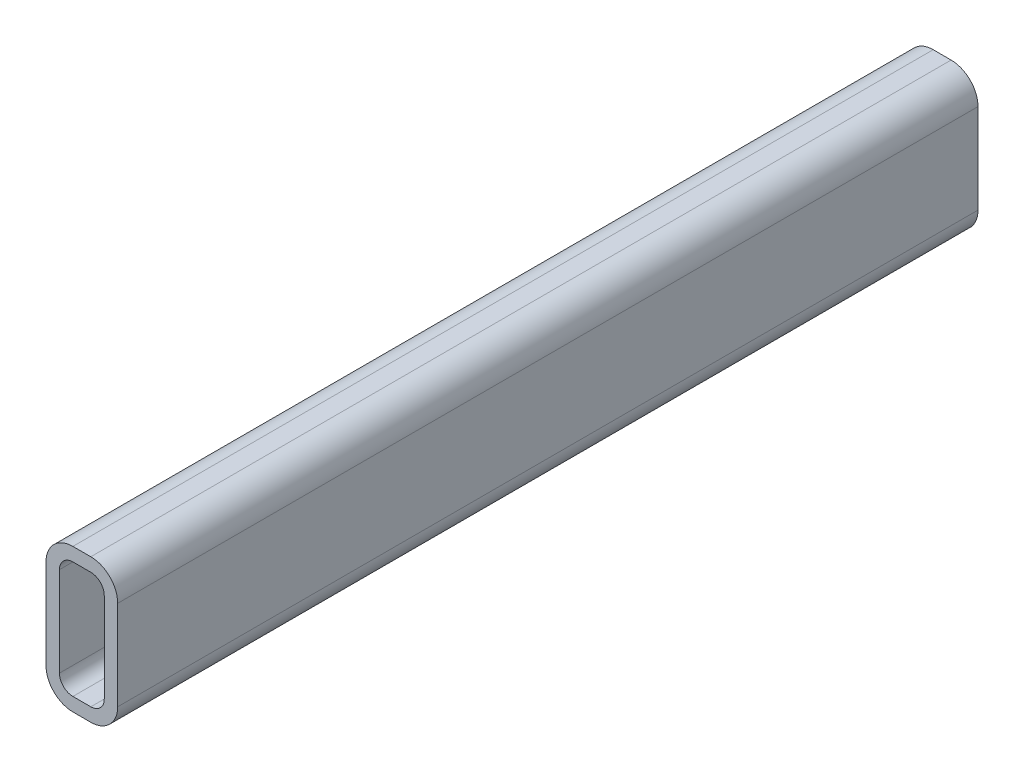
ISO-10303-21;
HEADER;
FILE_DESCRIPTION(('STEP AP214'),'2;1');
FILE_NAME('part.step','',(''),(''),'','','');
FILE_SCHEMA(('AUTOMOTIVE_DESIGN { 1 0 10303 214 1 1 1 1 }'));
ENDSEC;
DATA;
#1=APPLICATION_CONTEXT('core data for automotive mechanical design processes');
#2=APPLICATION_PROTOCOL_DEFINITION('international standard','automotive_design',2000,#1);
#3=PRODUCT_CONTEXT('',#1,'mechanical');
#4=PRODUCT('Part','Part','',(#3));
#5=PRODUCT_RELATED_PRODUCT_CATEGORY('part','',(#4));
#6=PRODUCT_DEFINITION_FORMATION('','',#4);
#7=PRODUCT_DEFINITION_CONTEXT('part definition',#1,'design');
#8=PRODUCT_DEFINITION('design','',#6,#7);
#9=PRODUCT_DEFINITION_SHAPE('','',#8);
#10=(LENGTH_UNIT() NAMED_UNIT(*) SI_UNIT(.MILLI.,.METRE.));
#11=(NAMED_UNIT(*) PLANE_ANGLE_UNIT() SI_UNIT($,.RADIAN.));
#12=(NAMED_UNIT(*) SI_UNIT($,.STERADIAN.) SOLID_ANGLE_UNIT());
#13=UNCERTAINTY_MEASURE_WITH_UNIT(LENGTH_MEASURE(1.E-05),#10,'distance_accuracy_value','');
#14=(GEOMETRIC_REPRESENTATION_CONTEXT(3) GLOBAL_UNCERTAINTY_ASSIGNED_CONTEXT((#13)) GLOBAL_UNIT_ASSIGNED_CONTEXT((#10,
#11,#12)) REPRESENTATION_CONTEXT('',''));
#15=CARTESIAN_POINT('',(0.,0.,0.));
#16=DIRECTION('',(0.,0.,1.));
#17=DIRECTION('',(1.,0.,0.));
#18=AXIS2_PLACEMENT_3D('',#15,#16,#17);
#19=CARTESIAN_POINT('',(9.525,41.275,304.8));
#20=DIRECTION('',(0.,0.,1.));
#21=DIRECTION('',(1.,0.,0.));
#22=AXIS2_PLACEMENT_3D('',#19,#20,#21);
#23=PLANE('',#22);
#24=CARTESIAN_POINT('',(9.525,41.275,304.8));
#25=DIRECTION('',(0.,0.,1.));
#26=DIRECTION('',(1.,0.,0.));
#27=AXIS2_PLACEMENT_3D('',#24,#25,#26);
#28=CIRCLE('',#27,9.525);
#29=CARTESIAN_POINT('',(9.525,50.8,304.8));
#30=VERTEX_POINT('',#29);
#31=CARTESIAN_POINT('',(0.,41.275,304.8));
#32=VERTEX_POINT('',#31);
#33=EDGE_CURVE('E211',#30,#32,#28,.T.);
#34=ORIENTED_EDGE('',*,*,#33,.T.);
#35=DIRECTION('',(0.,-1.,0.));
#36=VECTOR('',#35,1.);
#37=CARTESIAN_POINT('',(0.,9.525,304.8));
#38=LINE('',#37,#36);
#39=CARTESIAN_POINT('',(0.,9.525,304.8));
#40=VERTEX_POINT('',#39);
#41=EDGE_CURVE('E214',#32,#40,#38,.T.);
#42=ORIENTED_EDGE('',*,*,#41,.T.);
#43=CARTESIAN_POINT('',(9.525,9.525,304.8));
#44=DIRECTION('',(0.,0.,1.));
#45=DIRECTION('',(1.,0.,0.));
#46=AXIS2_PLACEMENT_3D('',#43,#44,#45);
#47=CIRCLE('',#46,9.525);
#48=CARTESIAN_POINT('',(9.525,0.,304.8));
#49=VERTEX_POINT('',#48);
#50=EDGE_CURVE('E217',#40,#49,#47,.T.);
#51=ORIENTED_EDGE('',*,*,#50,.T.);
#52=DIRECTION('',(1.,0.,0.));
#53=VECTOR('',#52,1.);
#54=CARTESIAN_POINT('',(15.875,0.,304.8));
#55=LINE('',#54,#53);
#56=CARTESIAN_POINT('',(15.875,0.,304.8));
#57=VERTEX_POINT('',#56);
#58=EDGE_CURVE('E219',#49,#57,#55,.T.);
#59=ORIENTED_EDGE('',*,*,#58,.T.);
#60=CARTESIAN_POINT('',(15.875,9.525,304.8));
#61=DIRECTION('',(0.,0.,1.));
#62=DIRECTION('',(1.,0.,0.));
#63=AXIS2_PLACEMENT_3D('',#60,#61,#62);
#64=CIRCLE('',#63,9.525);
#65=CARTESIAN_POINT('',(25.4,9.525,304.8));
#66=VERTEX_POINT('',#65);
#67=EDGE_CURVE('E221',#57,#66,#64,.T.);
#68=ORIENTED_EDGE('',*,*,#67,.T.);
#69=DIRECTION('',(0.,1.,0.));
#70=VECTOR('',#69,1.);
#71=CARTESIAN_POINT('',(25.4,41.275,304.8));
#72=LINE('',#71,#70);
#73=CARTESIAN_POINT('',(25.4,41.275,304.8));
#74=VERTEX_POINT('',#73);
#75=EDGE_CURVE('E223',#66,#74,#72,.T.);
#76=ORIENTED_EDGE('',*,*,#75,.T.);
#77=CARTESIAN_POINT('',(15.875,41.275,304.8));
#78=DIRECTION('',(0.,0.,1.));
#79=DIRECTION('',(1.,0.,0.));
#80=AXIS2_PLACEMENT_3D('',#77,#78,#79);
#81=CIRCLE('',#80,9.525);
#82=CARTESIAN_POINT('',(15.875,50.8,304.8));
#83=VERTEX_POINT('',#82);
#84=EDGE_CURVE('E225',#74,#83,#81,.T.);
#85=ORIENTED_EDGE('',*,*,#84,.T.);
#86=DIRECTION('',(-1.,0.,0.));
#87=VECTOR('',#86,1.);
#88=CARTESIAN_POINT('',(9.525,50.8,304.8));
#89=LINE('',#88,#87);
#90=EDGE_CURVE('E227',#83,#30,#89,.T.);
#91=ORIENTED_EDGE('',*,*,#90,.T.);
#92=EDGE_LOOP('',(#34,#42,#51,#59,#68,#76,#85,#91));
#93=FACE_BOUND('',#92,.T.);
#94=DIRECTION('',(0.,-1.,0.));
#95=VECTOR('',#94,1.);
#96=CARTESIAN_POINT('',(4.7625,9.525,304.8));
#97=LINE('',#96,#95);
#98=CARTESIAN_POINT('',(4.7625,41.275,304.8));
#99=VERTEX_POINT('',#98);
#100=CARTESIAN_POINT('',(4.7625,9.525,304.8));
#101=VERTEX_POINT('',#100);
#102=EDGE_CURVE('E154',#99,#101,#97,.T.);
#103=ORIENTED_EDGE('',*,*,#102,.F.);
#104=CARTESIAN_POINT('',(9.525,41.275,304.8));
#105=DIRECTION('',(0.,0.,1.));
#106=DIRECTION('',(1.,0.,0.));
#107=AXIS2_PLACEMENT_3D('',#104,#105,#106);
#108=CIRCLE('',#107,4.7625);
#109=CARTESIAN_POINT('',(9.525,46.0375,304.8));
#110=VERTEX_POINT('',#109);
#111=EDGE_CURVE('E146',#110,#99,#108,.T.);
#112=ORIENTED_EDGE('',*,*,#111,.F.);
#113=DIRECTION('',(-1.,0.,0.));
#114=VECTOR('',#113,1.);
#115=CARTESIAN_POINT('',(9.525,46.0375,304.8));
#116=LINE('',#115,#114);
#117=CARTESIAN_POINT('',(15.875,46.0375,304.8));
#118=VERTEX_POINT('',#117);
#119=EDGE_CURVE('E179',#118,#110,#116,.T.);
#120=ORIENTED_EDGE('',*,*,#119,.F.);
#121=CARTESIAN_POINT('',(15.875,41.275,304.8));
#122=DIRECTION('',(0.,0.,1.));
#123=DIRECTION('',(1.,0.,0.));
#124=AXIS2_PLACEMENT_3D('',#121,#122,#123);
#125=CIRCLE('',#124,4.7625);
#126=CARTESIAN_POINT('',(20.6375,41.275,304.8));
#127=VERTEX_POINT('',#126);
#128=EDGE_CURVE('E177',#127,#118,#125,.T.);
#129=ORIENTED_EDGE('',*,*,#128,.F.);
#130=DIRECTION('',(0.,1.,0.));
#131=VECTOR('',#130,1.);
#132=CARTESIAN_POINT('',(20.6375,41.275,304.8));
#133=LINE('',#132,#131);
#134=CARTESIAN_POINT('',(20.6375,9.525,304.8));
#135=VERTEX_POINT('',#134);
#136=EDGE_CURVE('E175',#135,#127,#133,.T.);
#137=ORIENTED_EDGE('',*,*,#136,.F.);
#138=CARTESIAN_POINT('',(15.875,9.525,304.8));
#139=DIRECTION('',(0.,0.,1.));
#140=DIRECTION('',(1.,0.,0.));
#141=AXIS2_PLACEMENT_3D('',#138,#139,#140);
#142=CIRCLE('',#141,4.7625);
#143=CARTESIAN_POINT('',(15.875,4.7625,304.8));
#144=VERTEX_POINT('',#143);
#145=EDGE_CURVE('E173',#144,#135,#142,.T.);
#146=ORIENTED_EDGE('',*,*,#145,.F.);
#147=DIRECTION('',(1.,0.,0.));
#148=VECTOR('',#147,1.);
#149=CARTESIAN_POINT('',(15.875,4.7625,304.8));
#150=LINE('',#149,#148);
#151=CARTESIAN_POINT('',(9.525,4.7625,304.8));
#152=VERTEX_POINT('',#151);
#153=EDGE_CURVE('E169',#152,#144,#150,.T.);
#154=ORIENTED_EDGE('',*,*,#153,.F.);
#155=CARTESIAN_POINT('',(9.525,9.525,304.8));
#156=DIRECTION('',(0.,0.,1.));
#157=DIRECTION('',(1.,0.,0.));
#158=AXIS2_PLACEMENT_3D('',#155,#156,#157);
#159=CIRCLE('',#158,4.7625);
#160=EDGE_CURVE('E167',#101,#152,#159,.T.);
#161=ORIENTED_EDGE('',*,*,#160,.F.);
#162=EDGE_LOOP('',(#103,#112,#120,#129,#137,#146,#154,#161));
#163=FACE_BOUND('',#162,.T.);
#164=ADVANCED_FACE('F33',(#93,#163),#23,.T.);
#165=CARTESIAN_POINT('',(9.525,41.275,0.));
#166=DIRECTION('',(0.,0.,1.));
#167=DIRECTION('',(1.,0.,0.));
#168=AXIS2_PLACEMENT_3D('',#165,#166,#167);
#169=PLANE('',#168);
#170=CARTESIAN_POINT('',(9.525,41.275,0.));
#171=DIRECTION('',(0.,0.,1.));
#172=DIRECTION('',(1.,0.,0.));
#173=AXIS2_PLACEMENT_3D('',#170,#171,#172);
#174=CIRCLE('',#173,9.525);
#175=CARTESIAN_POINT('',(9.525,50.8,0.));
#176=VERTEX_POINT('',#175);
#177=CARTESIAN_POINT('',(0.,41.275,0.));
#178=VERTEX_POINT('',#177);
#179=EDGE_CURVE('E162',#176,#178,#174,.T.);
#180=ORIENTED_EDGE('',*,*,#179,.F.);
#181=DIRECTION('',(-1.,0.,0.));
#182=VECTOR('',#181,1.);
#183=CARTESIAN_POINT('',(9.525,50.8,0.));
#184=LINE('',#183,#182);
#185=CARTESIAN_POINT('',(15.875,50.8,0.));
#186=VERTEX_POINT('',#185);
#187=EDGE_CURVE('E215',#186,#176,#184,.T.);
#188=ORIENTED_EDGE('',*,*,#187,.F.);
#189=CARTESIAN_POINT('',(15.875,41.275,0.));
#190=DIRECTION('',(0.,0.,1.));
#191=DIRECTION('',(1.,0.,0.));
#192=AXIS2_PLACEMENT_3D('',#189,#190,#191);
#193=CIRCLE('',#192,9.525);
#194=CARTESIAN_POINT('',(25.4,41.275,0.));
#195=VERTEX_POINT('',#194);
#196=EDGE_CURVE('E242',#195,#186,#193,.T.);
#197=ORIENTED_EDGE('',*,*,#196,.F.);
#198=DIRECTION('',(0.,1.,0.));
#199=VECTOR('',#198,1.);
#200=CARTESIAN_POINT('',(25.4,41.275,0.));
#201=LINE('',#200,#199);
#202=CARTESIAN_POINT('',(25.4,9.525,0.));
#203=VERTEX_POINT('',#202);
#204=EDGE_CURVE('E240',#203,#195,#201,.T.);
#205=ORIENTED_EDGE('',*,*,#204,.F.);
#206=CARTESIAN_POINT('',(15.875,9.525,0.));
#207=DIRECTION('',(0.,0.,1.));
#208=DIRECTION('',(1.,0.,0.));
#209=AXIS2_PLACEMENT_3D('',#206,#207,#208);
#210=CIRCLE('',#209,9.525);
#211=CARTESIAN_POINT('',(15.875,0.,0.));
#212=VERTEX_POINT('',#211);
#213=EDGE_CURVE('E238',#212,#203,#210,.T.);
#214=ORIENTED_EDGE('',*,*,#213,.F.);
#215=DIRECTION('',(1.,0.,0.));
#216=VECTOR('',#215,1.);
#217=CARTESIAN_POINT('',(15.875,0.,0.));
#218=LINE('',#217,#216);
#219=CARTESIAN_POINT('',(9.525,0.,0.));
#220=VERTEX_POINT('',#219);
#221=EDGE_CURVE('E236',#220,#212,#218,.T.);
#222=ORIENTED_EDGE('',*,*,#221,.F.);
#223=CARTESIAN_POINT('',(9.525,9.525,0.));
#224=DIRECTION('',(0.,0.,1.));
#225=DIRECTION('',(1.,0.,0.));
#226=AXIS2_PLACEMENT_3D('',#223,#224,#225);
#227=CIRCLE('',#226,9.525);
#228=CARTESIAN_POINT('',(0.,9.525,0.));
#229=VERTEX_POINT('',#228);
#230=EDGE_CURVE('E234',#229,#220,#227,.T.);
#231=ORIENTED_EDGE('',*,*,#230,.F.);
#232=DIRECTION('',(0.,-1.,0.));
#233=VECTOR('',#232,1.);
#234=CARTESIAN_POINT('',(0.,9.525,0.));
#235=LINE('',#234,#233);
#236=EDGE_CURVE('E232',#178,#229,#235,.T.);
#237=ORIENTED_EDGE('',*,*,#236,.F.);
#238=EDGE_LOOP('',(#180,#188,#197,#205,#214,#222,#231,#237));
#239=FACE_BOUND('',#238,.T.);
#240=CARTESIAN_POINT('',(9.525,41.275,0.));
#241=DIRECTION('',(0.,0.,1.));
#242=DIRECTION('',(1.,0.,0.));
#243=AXIS2_PLACEMENT_3D('',#240,#241,#242);
#244=CIRCLE('',#243,4.7625);
#245=CARTESIAN_POINT('',(9.525,46.0375,0.));
#246=VERTEX_POINT('',#245);
#247=CARTESIAN_POINT('',(4.7625,41.275,0.));
#248=VERTEX_POINT('',#247);
#249=EDGE_CURVE('E56',#246,#248,#244,.T.);
#250=ORIENTED_EDGE('',*,*,#249,.T.);
#251=DIRECTION('',(0.,-1.,0.));
#252=VECTOR('',#251,1.);
#253=CARTESIAN_POINT('',(4.7625,9.525,0.));
#254=LINE('',#253,#252);
#255=CARTESIAN_POINT('',(4.7625,9.525,0.));
#256=VERTEX_POINT('',#255);
#257=EDGE_CURVE('E161',#248,#256,#254,.T.);
#258=ORIENTED_EDGE('',*,*,#257,.T.);
#259=CARTESIAN_POINT('',(9.525,9.525,0.));
#260=DIRECTION('',(0.,0.,1.));
#261=DIRECTION('',(1.,0.,0.));
#262=AXIS2_PLACEMENT_3D('',#259,#260,#261);
#263=CIRCLE('',#262,4.7625);
#264=CARTESIAN_POINT('',(9.525,4.7625,0.));
#265=VERTEX_POINT('',#264);
#266=EDGE_CURVE('E183',#256,#265,#263,.T.);
#267=ORIENTED_EDGE('',*,*,#266,.T.);
#268=DIRECTION('',(1.,0.,0.));
#269=VECTOR('',#268,1.);
#270=CARTESIAN_POINT('',(15.875,4.7625,0.));
#271=LINE('',#270,#269);
#272=CARTESIAN_POINT('',(15.875,4.7625,0.));
#273=VERTEX_POINT('',#272);
#274=EDGE_CURVE('E186',#265,#273,#271,.T.);
#275=ORIENTED_EDGE('',*,*,#274,.T.);
#276=CARTESIAN_POINT('',(15.875,9.525,0.));
#277=DIRECTION('',(0.,0.,1.));
#278=DIRECTION('',(1.,0.,0.));
#279=AXIS2_PLACEMENT_3D('',#276,#277,#278);
#280=CIRCLE('',#279,4.7625);
#281=CARTESIAN_POINT('',(20.6375,9.525,0.));
#282=VERTEX_POINT('',#281);
#283=EDGE_CURVE('E189',#273,#282,#280,.T.);
#284=ORIENTED_EDGE('',*,*,#283,.T.);
#285=DIRECTION('',(0.,1.,0.));
#286=VECTOR('',#285,1.);
#287=CARTESIAN_POINT('',(20.6375,41.275,0.));
#288=LINE('',#287,#286);
#289=CARTESIAN_POINT('',(20.6375,41.275,0.));
#290=VERTEX_POINT('',#289);
#291=EDGE_CURVE('E192',#282,#290,#288,.T.);
#292=ORIENTED_EDGE('',*,*,#291,.T.);
#293=CARTESIAN_POINT('',(15.875,41.275,0.));
#294=DIRECTION('',(0.,0.,1.));
#295=DIRECTION('',(1.,0.,0.));
#296=AXIS2_PLACEMENT_3D('',#293,#294,#295);
#297=CIRCLE('',#296,4.7625);
#298=CARTESIAN_POINT('',(15.875,46.0375,0.));
#299=VERTEX_POINT('',#298);
#300=EDGE_CURVE('E195',#290,#299,#297,.T.);
#301=ORIENTED_EDGE('',*,*,#300,.T.);
#302=DIRECTION('',(-1.,0.,0.));
#303=VECTOR('',#302,1.);
#304=CARTESIAN_POINT('',(9.525,46.0375,0.));
#305=LINE('',#304,#303);
#306=EDGE_CURVE('E155',#299,#246,#305,.T.);
#307=ORIENTED_EDGE('',*,*,#306,.T.);
#308=EDGE_LOOP('',(#250,#258,#267,#275,#284,#292,#301,#307));
#309=FACE_BOUND('',#308,.T.);
#310=ADVANCED_FACE('F272',(#239,#309),#169,.F.);
#311=CARTESIAN_POINT('',(9.525,41.275,304.8));
#312=DIRECTION('',(0.,0.,-1.));
#313=DIRECTION('',(-1.,0.,0.));
#314=AXIS2_PLACEMENT_3D('',#311,#312,#313);
#315=CYLINDRICAL_SURFACE('',#314,9.525);
#316=ORIENTED_EDGE('',*,*,#179,.T.);
#317=DIRECTION('',(0.,0.,-1.));
#318=VECTOR('',#317,1.);
#319=CARTESIAN_POINT('',(0.,41.275,304.8));
#320=LINE('',#319,#318);
#321=EDGE_CURVE('E11',#32,#178,#320,.T.);
#322=ORIENTED_EDGE('',*,*,#321,.F.);
#323=ORIENTED_EDGE('',*,*,#33,.F.);
#324=DIRECTION('',(0.,0.,-1.));
#325=VECTOR('',#324,1.);
#326=CARTESIAN_POINT('',(9.525,50.8,304.8));
#327=LINE('',#326,#325);
#328=EDGE_CURVE('E229',#30,#176,#327,.T.);
#329=ORIENTED_EDGE('',*,*,#328,.T.);
#330=EDGE_LOOP('',(#316,#322,#323,#329));
#331=FACE_BOUND('',#330,.T.);
#332=ADVANCED_FACE('F35',(#331),#315,.T.);
#333=CARTESIAN_POINT('',(0.,9.525,304.8));
#334=DIRECTION('',(1.,0.,0.));
#335=DIRECTION('',(0.,0.,-1.));
#336=AXIS2_PLACEMENT_3D('',#333,#334,#335);
#337=PLANE('',#336);
#338=ORIENTED_EDGE('',*,*,#236,.T.);
#339=DIRECTION('',(0.,0.,-1.));
#340=VECTOR('',#339,1.);
#341=CARTESIAN_POINT('',(0.,9.525,304.8));
#342=LINE('',#341,#340);
#343=EDGE_CURVE('E41',#40,#229,#342,.T.);
#344=ORIENTED_EDGE('',*,*,#343,.F.);
#345=ORIENTED_EDGE('',*,*,#41,.F.);
#346=ORIENTED_EDGE('',*,*,#321,.T.);
#347=EDGE_LOOP('',(#338,#344,#345,#346));
#348=FACE_BOUND('',#347,.T.);
#349=ADVANCED_FACE('F289',(#348),#337,.F.);
#350=CARTESIAN_POINT('',(9.525,9.525,304.8));
#351=DIRECTION('',(0.,0.,-1.));
#352=DIRECTION('',(-1.,0.,0.));
#353=AXIS2_PLACEMENT_3D('',#350,#351,#352);
#354=CYLINDRICAL_SURFACE('',#353,9.525);
#355=ORIENTED_EDGE('',*,*,#230,.T.);
#356=DIRECTION('',(0.,0.,-1.));
#357=VECTOR('',#356,1.);
#358=CARTESIAN_POINT('',(9.525,0.,304.8));
#359=LINE('',#358,#357);
#360=EDGE_CURVE('E259',#49,#220,#359,.T.);
#361=ORIENTED_EDGE('',*,*,#360,.F.);
#362=ORIENTED_EDGE('',*,*,#50,.F.);
#363=ORIENTED_EDGE('',*,*,#343,.T.);
#364=EDGE_LOOP('',(#355,#361,#362,#363));
#365=FACE_BOUND('',#364,.T.);
#366=ADVANCED_FACE('F266',(#365),#354,.T.);
#367=CARTESIAN_POINT('',(15.875,0.,304.8));
#368=DIRECTION('',(0.,1.,0.));
#369=DIRECTION('',(0.,0.,1.));
#370=AXIS2_PLACEMENT_3D('',#367,#368,#369);
#371=PLANE('',#370);
#372=ORIENTED_EDGE('',*,*,#221,.T.);
#373=DIRECTION('',(0.,0.,-1.));
#374=VECTOR('',#373,1.);
#375=CARTESIAN_POINT('',(15.875,0.,304.8));
#376=LINE('',#375,#374);
#377=EDGE_CURVE('E256',#57,#212,#376,.T.);
#378=ORIENTED_EDGE('',*,*,#377,.F.);
#379=ORIENTED_EDGE('',*,*,#58,.F.);
#380=ORIENTED_EDGE('',*,*,#360,.T.);
#381=EDGE_LOOP('',(#372,#378,#379,#380));
#382=FACE_BOUND('',#381,.T.);
#383=ADVANCED_FACE('F278',(#382),#371,.F.);
#384=CARTESIAN_POINT('',(15.875,9.525,304.8));
#385=DIRECTION('',(0.,0.,-1.));
#386=DIRECTION('',(-1.,0.,0.));
#387=AXIS2_PLACEMENT_3D('',#384,#385,#386);
#388=CYLINDRICAL_SURFACE('',#387,9.525);
#389=ORIENTED_EDGE('',*,*,#213,.T.);
#390=DIRECTION('',(0.,0.,-1.));
#391=VECTOR('',#390,1.);
#392=CARTESIAN_POINT('',(25.4,9.525,304.8));
#393=LINE('',#392,#391);
#394=EDGE_CURVE('E253',#66,#203,#393,.T.);
#395=ORIENTED_EDGE('',*,*,#394,.F.);
#396=ORIENTED_EDGE('',*,*,#67,.F.);
#397=ORIENTED_EDGE('',*,*,#377,.T.);
#398=EDGE_LOOP('',(#389,#395,#396,#397));
#399=FACE_BOUND('',#398,.T.);
#400=ADVANCED_FACE('F282',(#399),#388,.T.);
#401=CARTESIAN_POINT('',(25.4,41.275,304.8));
#402=DIRECTION('',(-1.,0.,0.));
#403=DIRECTION('',(0.,0.,1.));
#404=AXIS2_PLACEMENT_3D('',#401,#402,#403);
#405=PLANE('',#404);
#406=ORIENTED_EDGE('',*,*,#204,.T.);
#407=DIRECTION('',(0.,0.,-1.));
#408=VECTOR('',#407,1.);
#409=CARTESIAN_POINT('',(25.4,41.275,304.8));
#410=LINE('',#409,#408);
#411=EDGE_CURVE('E250',#74,#195,#410,.T.);
#412=ORIENTED_EDGE('',*,*,#411,.F.);
#413=ORIENTED_EDGE('',*,*,#75,.F.);
#414=ORIENTED_EDGE('',*,*,#394,.T.);
#415=EDGE_LOOP('',(#406,#412,#413,#414));
#416=FACE_BOUND('',#415,.T.);
#417=ADVANCED_FACE('F302',(#416),#405,.F.);
#418=CARTESIAN_POINT('',(15.875,41.275,304.8));
#419=DIRECTION('',(0.,0.,-1.));
#420=DIRECTION('',(-1.,0.,0.));
#421=AXIS2_PLACEMENT_3D('',#418,#419,#420);
#422=CYLINDRICAL_SURFACE('',#421,9.525);
#423=ORIENTED_EDGE('',*,*,#196,.T.);
#424=DIRECTION('',(0.,0.,-1.));
#425=VECTOR('',#424,1.);
#426=CARTESIAN_POINT('',(15.875,50.8,304.8));
#427=LINE('',#426,#425);
#428=EDGE_CURVE('E247',#83,#186,#427,.T.);
#429=ORIENTED_EDGE('',*,*,#428,.F.);
#430=ORIENTED_EDGE('',*,*,#84,.F.);
#431=ORIENTED_EDGE('',*,*,#411,.T.);
#432=EDGE_LOOP('',(#423,#429,#430,#431));
#433=FACE_BOUND('',#432,.T.);
#434=ADVANCED_FACE('F300',(#433),#422,.T.);
#435=CARTESIAN_POINT('',(9.525,50.8,304.8));
#436=DIRECTION('',(0.,-1.,0.));
#437=DIRECTION('',(0.,0.,-1.));
#438=AXIS2_PLACEMENT_3D('',#435,#436,#437);
#439=PLANE('',#438);
#440=ORIENTED_EDGE('',*,*,#187,.T.);
#441=ORIENTED_EDGE('',*,*,#328,.F.);
#442=ORIENTED_EDGE('',*,*,#90,.F.);
#443=ORIENTED_EDGE('',*,*,#428,.T.);
#444=EDGE_LOOP('',(#440,#441,#442,#443));
#445=FACE_BOUND('',#444,.T.);
#446=ADVANCED_FACE('F295',(#445),#439,.F.);
#447=CARTESIAN_POINT('',(9.525,41.275,304.8));
#448=DIRECTION('',(0.,0.,-1.));
#449=DIRECTION('',(-1.,0.,0.));
#450=AXIS2_PLACEMENT_3D('',#447,#448,#449);
#451=CYLINDRICAL_SURFACE('',#450,4.7625);
#452=ORIENTED_EDGE('',*,*,#249,.F.);
#453=DIRECTION('',(0.,0.,-1.));
#454=VECTOR('',#453,1.);
#455=CARTESIAN_POINT('',(9.525,46.0375,304.8));
#456=LINE('',#455,#454);
#457=EDGE_CURVE('E150',#110,#246,#456,.T.);
#458=ORIENTED_EDGE('',*,*,#457,.F.);
#459=ORIENTED_EDGE('',*,*,#111,.T.);
#460=DIRECTION('',(0.,0.,-1.));
#461=VECTOR('',#460,1.);
#462=CARTESIAN_POINT('',(4.7625,41.275,304.8));
#463=LINE('',#462,#461);
#464=EDGE_CURVE('E149',#99,#248,#463,.T.);
#465=ORIENTED_EDGE('',*,*,#464,.T.);
#466=EDGE_LOOP('',(#452,#458,#459,#465));
#467=FACE_BOUND('',#466,.T.);
#468=ADVANCED_FACE('F148',(#467),#451,.F.);
#469=CARTESIAN_POINT('',(4.7625,9.525,304.8));
#470=DIRECTION('',(1.,0.,0.));
#471=DIRECTION('',(0.,0.,-1.));
#472=AXIS2_PLACEMENT_3D('',#469,#470,#471);
#473=PLANE('',#472);
#474=ORIENTED_EDGE('',*,*,#257,.F.);
#475=ORIENTED_EDGE('',*,*,#464,.F.);
#476=ORIENTED_EDGE('',*,*,#102,.T.);
#477=DIRECTION('',(0.,0.,-1.));
#478=VECTOR('',#477,1.);
#479=CARTESIAN_POINT('',(4.7625,9.525,304.8));
#480=LINE('',#479,#478);
#481=EDGE_CURVE('E163',#101,#256,#480,.T.);
#482=ORIENTED_EDGE('',*,*,#481,.T.);
#483=EDGE_LOOP('',(#474,#475,#476,#482));
#484=FACE_BOUND('',#483,.T.);
#485=ADVANCED_FACE('F158',(#484),#473,.T.);
#486=CARTESIAN_POINT('',(9.525,9.525,304.8));
#487=DIRECTION('',(0.,0.,-1.));
#488=DIRECTION('',(-1.,0.,0.));
#489=AXIS2_PLACEMENT_3D('',#486,#487,#488);
#490=CYLINDRICAL_SURFACE('',#489,4.7625);
#491=ORIENTED_EDGE('',*,*,#266,.F.);
#492=ORIENTED_EDGE('',*,*,#481,.F.);
#493=ORIENTED_EDGE('',*,*,#160,.T.);
#494=DIRECTION('',(0.,0.,-1.));
#495=VECTOR('',#494,1.);
#496=CARTESIAN_POINT('',(9.525,4.7625,304.8));
#497=LINE('',#496,#495);
#498=EDGE_CURVE('E208',#152,#265,#497,.T.);
#499=ORIENTED_EDGE('',*,*,#498,.T.);
#500=EDGE_LOOP('',(#491,#492,#493,#499));
#501=FACE_BOUND('',#500,.T.);
#502=ADVANCED_FACE('F327',(#501),#490,.F.);
#503=CARTESIAN_POINT('',(15.875,4.7625,304.8));
#504=DIRECTION('',(0.,1.,0.));
#505=DIRECTION('',(0.,0.,1.));
#506=AXIS2_PLACEMENT_3D('',#503,#504,#505);
#507=PLANE('',#506);
#508=ORIENTED_EDGE('',*,*,#274,.F.);
#509=ORIENTED_EDGE('',*,*,#498,.F.);
#510=ORIENTED_EDGE('',*,*,#153,.T.);
#511=DIRECTION('',(0.,0.,-1.));
#512=VECTOR('',#511,1.);
#513=CARTESIAN_POINT('',(15.875,4.7625,304.8));
#514=LINE('',#513,#512);
#515=EDGE_CURVE('E206',#144,#273,#514,.T.);
#516=ORIENTED_EDGE('',*,*,#515,.T.);
#517=EDGE_LOOP('',(#508,#509,#510,#516));
#518=FACE_BOUND('',#517,.T.);
#519=ADVANCED_FACE('F331',(#518),#507,.T.);
#520=CARTESIAN_POINT('',(15.875,9.525,304.8));
#521=DIRECTION('',(0.,0.,-1.));
#522=DIRECTION('',(-1.,0.,0.));
#523=AXIS2_PLACEMENT_3D('',#520,#521,#522);
#524=CYLINDRICAL_SURFACE('',#523,4.7625);
#525=ORIENTED_EDGE('',*,*,#283,.F.);
#526=ORIENTED_EDGE('',*,*,#515,.F.);
#527=ORIENTED_EDGE('',*,*,#145,.T.);
#528=DIRECTION('',(0.,0.,-1.));
#529=VECTOR('',#528,1.);
#530=CARTESIAN_POINT('',(20.6375,9.525,304.8));
#531=LINE('',#530,#529);
#532=EDGE_CURVE('E204',#135,#282,#531,.T.);
#533=ORIENTED_EDGE('',*,*,#532,.T.);
#534=EDGE_LOOP('',(#525,#526,#527,#533));
#535=FACE_BOUND('',#534,.T.);
#536=ADVANCED_FACE('F337',(#535),#524,.F.);
#537=CARTESIAN_POINT('',(20.6375,41.275,304.8));
#538=DIRECTION('',(-1.,0.,0.));
#539=DIRECTION('',(0.,0.,1.));
#540=AXIS2_PLACEMENT_3D('',#537,#538,#539);
#541=PLANE('',#540);
#542=ORIENTED_EDGE('',*,*,#291,.F.);
#543=ORIENTED_EDGE('',*,*,#532,.F.);
#544=ORIENTED_EDGE('',*,*,#136,.T.);
#545=DIRECTION('',(0.,0.,-1.));
#546=VECTOR('',#545,1.);
#547=CARTESIAN_POINT('',(20.6375,41.275,304.8));
#548=LINE('',#547,#546);
#549=EDGE_CURVE('E202',#127,#290,#548,.T.);
#550=ORIENTED_EDGE('',*,*,#549,.T.);
#551=EDGE_LOOP('',(#542,#543,#544,#550));
#552=FACE_BOUND('',#551,.T.);
#553=ADVANCED_FACE('F341',(#552),#541,.T.);
#554=CARTESIAN_POINT('',(15.875,41.275,304.8));
#555=DIRECTION('',(0.,0.,-1.));
#556=DIRECTION('',(-1.,0.,0.));
#557=AXIS2_PLACEMENT_3D('',#554,#555,#556);
#558=CYLINDRICAL_SURFACE('',#557,4.7625);
#559=ORIENTED_EDGE('',*,*,#300,.F.);
#560=ORIENTED_EDGE('',*,*,#549,.F.);
#561=ORIENTED_EDGE('',*,*,#128,.T.);
#562=DIRECTION('',(0.,0.,-1.));
#563=VECTOR('',#562,1.);
#564=CARTESIAN_POINT('',(15.875,46.0375,304.8));
#565=LINE('',#564,#563);
#566=EDGE_CURVE('E48',#118,#299,#565,.T.);
#567=ORIENTED_EDGE('',*,*,#566,.T.);
#568=EDGE_LOOP('',(#559,#560,#561,#567));
#569=FACE_BOUND('',#568,.T.);
#570=ADVANCED_FACE('F345',(#569),#558,.F.);
#571=CARTESIAN_POINT('',(9.525,46.0375,304.8));
#572=DIRECTION('',(0.,-1.,0.));
#573=DIRECTION('',(0.,0.,-1.));
#574=AXIS2_PLACEMENT_3D('',#571,#572,#573);
#575=PLANE('',#574);
#576=ORIENTED_EDGE('',*,*,#306,.F.);
#577=ORIENTED_EDGE('',*,*,#566,.F.);
#578=ORIENTED_EDGE('',*,*,#119,.T.);
#579=ORIENTED_EDGE('',*,*,#457,.T.);
#580=EDGE_LOOP('',(#576,#577,#578,#579));
#581=FACE_BOUND('',#580,.T.);
#582=ADVANCED_FACE('F349',(#581),#575,.T.);
#583=CLOSED_SHELL('',(#164,#310,#332,#349,#366,#383,#400,#417,#434,#446,#468,#485,#502,#519,
#536,#553,#570,#582));
#584=MANIFOLD_SOLID_BREP('B2',#583);
#585=ADVANCED_BREP_SHAPE_REPRESENTATION('',(#18,#584),#14);
#586=SHAPE_DEFINITION_REPRESENTATION(#9,#585);
ENDSEC;
END-ISO-10303-21;
